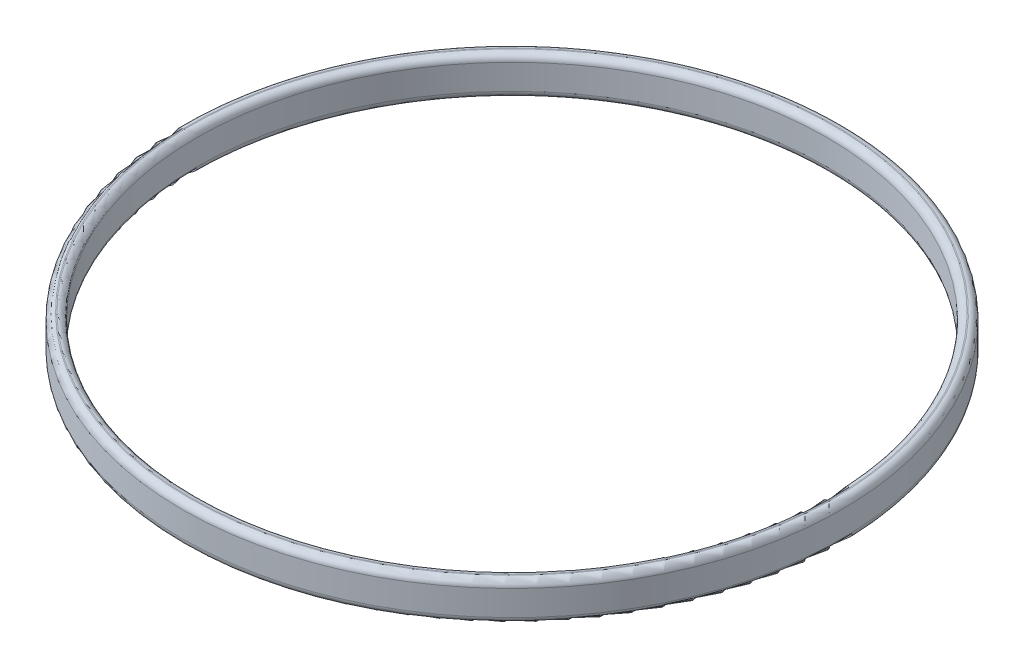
ISO-10303-21;
HEADER;
FILE_DESCRIPTION(('STEP AP214'),'2;1');
FILE_NAME('part.step','',(''),(''),'','','');
FILE_SCHEMA(('AUTOMOTIVE_DESIGN { 1 0 10303 214 1 1 1 1 }'));
ENDSEC;
DATA;
#1=APPLICATION_CONTEXT('core data for automotive mechanical design processes');
#2=APPLICATION_PROTOCOL_DEFINITION('international standard','automotive_design',2000,#1);
#3=PRODUCT_CONTEXT('',#1,'mechanical');
#4=PRODUCT('Part','Part','',(#3));
#5=PRODUCT_RELATED_PRODUCT_CATEGORY('part','',(#4));
#6=PRODUCT_DEFINITION_FORMATION('','',#4);
#7=PRODUCT_DEFINITION_CONTEXT('part definition',#1,'design');
#8=PRODUCT_DEFINITION('design','',#6,#7);
#9=PRODUCT_DEFINITION_SHAPE('','',#8);
#10=(LENGTH_UNIT() NAMED_UNIT(*) SI_UNIT(.MILLI.,.METRE.));
#11=(NAMED_UNIT(*) PLANE_ANGLE_UNIT() SI_UNIT($,.RADIAN.));
#12=(NAMED_UNIT(*) SI_UNIT($,.STERADIAN.) SOLID_ANGLE_UNIT());
#13=UNCERTAINTY_MEASURE_WITH_UNIT(LENGTH_MEASURE(1.E-05),#10,'distance_accuracy_value','');
#14=(GEOMETRIC_REPRESENTATION_CONTEXT(3) GLOBAL_UNCERTAINTY_ASSIGNED_CONTEXT((#13)) GLOBAL_UNIT_ASSIGNED_CONTEXT((#10,
#11,#12)) REPRESENTATION_CONTEXT('',''));
#15=CARTESIAN_POINT('',(0.,0.,0.));
#16=DIRECTION('',(0.,0.,1.));
#17=DIRECTION('',(1.,0.,0.));
#18=AXIS2_PLACEMENT_3D('',#15,#16,#17);
#19=CARTESIAN_POINT('',(0.,1.651,0.));
#20=DIRECTION('',(0.,1.,0.));
#21=DIRECTION('',(0.,0.,1.));
#22=AXIS2_PLACEMENT_3D('',#19,#20,#21);
#23=TOROIDAL_SURFACE('',#22,42.164,0.889000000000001);
#24=CARTESIAN_POINT('',(0.,1.651,0.));
#25=DIRECTION('',(0.,1.,0.));
#26=DIRECTION('',(0.,0.,1.));
#27=AXIS2_PLACEMENT_3D('',#24,#25,#26);
#28=CIRCLE('',#27,41.275);
#29=CARTESIAN_POINT('',(0.,1.651,41.275));
#30=VERTEX_POINT('',#29);
#31=EDGE_CURVE('E60',#30,#30,#28,.T.);
#32=ORIENTED_EDGE('',*,*,#31,.F.);
#33=EDGE_LOOP('',(#32));
#34=FACE_BOUND('',#33,.T.);
#35=CARTESIAN_POINT('',(0.,2.54,0.));
#36=DIRECTION('',(0.,1.,0.));
#37=DIRECTION('',(0.,0.,1.));
#38=AXIS2_PLACEMENT_3D('',#35,#36,#37);
#39=CIRCLE('',#38,42.164);
#40=CARTESIAN_POINT('',(0.,2.54,42.164));
#41=VERTEX_POINT('',#40);
#42=EDGE_CURVE('E10',#41,#41,#39,.T.);
#43=ORIENTED_EDGE('',*,*,#42,.T.);
#44=EDGE_LOOP('',(#43));
#45=FACE_BOUND('',#44,.T.);
#46=ADVANCED_FACE('F32',(#34,#45),#23,.T.);
#47=CARTESIAN_POINT('',(42.164,2.54,0.));
#48=DIRECTION('',(0.,-1.,0.));
#49=DIRECTION('',(0.,0.,-1.));
#50=AXIS2_PLACEMENT_3D('',#47,#48,#49);
#51=PLANE('',#50);
#52=ORIENTED_EDGE('',*,*,#42,.F.);
#53=EDGE_LOOP('',(#52));
#54=FACE_BOUND('',#53,.T.);
#55=CARTESIAN_POINT('',(0.,2.54,0.));
#56=DIRECTION('',(0.,1.,0.));
#57=DIRECTION('',(0.,0.,1.));
#58=AXIS2_PLACEMENT_3D('',#55,#56,#57);
#59=CIRCLE('',#58,42.291);
#60=CARTESIAN_POINT('',(0.,2.54,42.291));
#61=VERTEX_POINT('',#60);
#62=EDGE_CURVE('E38',#61,#61,#59,.T.);
#63=ORIENTED_EDGE('',*,*,#62,.T.);
#64=EDGE_LOOP('',(#63));
#65=FACE_BOUND('',#64,.T.);
#66=ADVANCED_FACE('F67',(#54,#65),#51,.F.);
#67=CARTESIAN_POINT('',(0.,1.651,0.));
#68=DIRECTION('',(0.,1.,0.));
#69=DIRECTION('',(0.,0.,1.));
#70=AXIS2_PLACEMENT_3D('',#67,#68,#69);
#71=TOROIDAL_SURFACE('',#70,42.291,0.889000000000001);
#72=ORIENTED_EDGE('',*,*,#62,.F.);
#73=EDGE_LOOP('',(#72));
#74=FACE_BOUND('',#73,.T.);
#75=CARTESIAN_POINT('',(0.,1.651,0.));
#76=DIRECTION('',(0.,1.,0.));
#77=DIRECTION('',(0.,0.,1.));
#78=AXIS2_PLACEMENT_3D('',#75,#76,#77);
#79=CIRCLE('',#78,43.18);
#80=CARTESIAN_POINT('',(0.,1.651,43.18));
#81=VERTEX_POINT('',#80);
#82=EDGE_CURVE('E42',#81,#81,#79,.T.);
#83=ORIENTED_EDGE('',*,*,#82,.T.);
#84=EDGE_LOOP('',(#83));
#85=FACE_BOUND('',#84,.T.);
#86=ADVANCED_FACE('F71',(#74,#85),#71,.T.);
#87=CARTESIAN_POINT('',(0.,14.7091224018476,0.));
#88=DIRECTION('',(0.,1.,0.));
#89=DIRECTION('',(0.,0.,1.));
#90=AXIS2_PLACEMENT_3D('',#87,#88,#89);
#91=CYLINDRICAL_SURFACE('',#90,43.18);
#92=ORIENTED_EDGE('',*,*,#82,.F.);
#93=EDGE_LOOP('',(#92));
#94=FACE_BOUND('',#93,.T.);
#95=CARTESIAN_POINT('',(0.,-1.651,0.));
#96=DIRECTION('',(0.,1.,0.));
#97=DIRECTION('',(0.,0.,1.));
#98=AXIS2_PLACEMENT_3D('',#95,#96,#97);
#99=CIRCLE('',#98,43.18);
#100=CARTESIAN_POINT('',(0.,-1.651,43.18));
#101=VERTEX_POINT('',#100);
#102=EDGE_CURVE('E46',#101,#101,#99,.T.);
#103=ORIENTED_EDGE('',*,*,#102,.T.);
#104=EDGE_LOOP('',(#103));
#105=FACE_BOUND('',#104,.T.);
#106=ADVANCED_FACE('F76',(#94,#105),#91,.T.);
#107=CARTESIAN_POINT('',(0.,-1.651,0.));
#108=DIRECTION('',(0.,1.,0.));
#109=DIRECTION('',(0.,0.,1.));
#110=AXIS2_PLACEMENT_3D('',#107,#108,#109);
#111=TOROIDAL_SURFACE('',#110,42.291,0.889000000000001);
#112=ORIENTED_EDGE('',*,*,#102,.F.);
#113=EDGE_LOOP('',(#112));
#114=FACE_BOUND('',#113,.T.);
#115=CARTESIAN_POINT('',(0.,-2.54,0.));
#116=DIRECTION('',(0.,1.,0.));
#117=DIRECTION('',(0.,0.,1.));
#118=AXIS2_PLACEMENT_3D('',#115,#116,#117);
#119=CIRCLE('',#118,42.291);
#120=CARTESIAN_POINT('',(0.,-2.54,42.291));
#121=VERTEX_POINT('',#120);
#122=EDGE_CURVE('E51',#121,#121,#119,.T.);
#123=ORIENTED_EDGE('',*,*,#122,.T.);
#124=EDGE_LOOP('',(#123));
#125=FACE_BOUND('',#124,.T.);
#126=ADVANCED_FACE('F82',(#114,#125),#111,.T.);
#127=CARTESIAN_POINT('',(42.164,-2.54,0.));
#128=DIRECTION('',(0.,1.,0.));
#129=DIRECTION('',(0.,0.,1.));
#130=AXIS2_PLACEMENT_3D('',#127,#128,#129);
#131=PLANE('',#130);
#132=ORIENTED_EDGE('',*,*,#122,.F.);
#133=EDGE_LOOP('',(#132));
#134=FACE_BOUND('',#133,.T.);
#135=CARTESIAN_POINT('',(0.,-2.54,0.));
#136=DIRECTION('',(0.,1.,0.));
#137=DIRECTION('',(0.,0.,1.));
#138=AXIS2_PLACEMENT_3D('',#135,#136,#137);
#139=CIRCLE('',#138,42.164);
#140=CARTESIAN_POINT('',(0.,-2.54,42.164));
#141=VERTEX_POINT('',#140);
#142=EDGE_CURVE('E54',#141,#141,#139,.T.);
#143=ORIENTED_EDGE('',*,*,#142,.T.);
#144=EDGE_LOOP('',(#143));
#145=FACE_BOUND('',#144,.T.);
#146=ADVANCED_FACE('F86',(#134,#145),#131,.F.);
#147=CARTESIAN_POINT('',(0.,-1.651,0.));
#148=DIRECTION('',(0.,1.,0.));
#149=DIRECTION('',(0.,0.,1.));
#150=AXIS2_PLACEMENT_3D('',#147,#148,#149);
#151=TOROIDAL_SURFACE('',#150,42.164,0.889000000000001);
#152=ORIENTED_EDGE('',*,*,#142,.F.);
#153=EDGE_LOOP('',(#152));
#154=FACE_BOUND('',#153,.T.);
#155=CARTESIAN_POINT('',(0.,-1.651,0.));
#156=DIRECTION('',(0.,1.,0.));
#157=DIRECTION('',(0.,0.,1.));
#158=AXIS2_PLACEMENT_3D('',#155,#156,#157);
#159=CIRCLE('',#158,41.275);
#160=CARTESIAN_POINT('',(0.,-1.651,41.275));
#161=VERTEX_POINT('',#160);
#162=EDGE_CURVE('E57',#161,#161,#159,.T.);
#163=ORIENTED_EDGE('',*,*,#162,.T.);
#164=EDGE_LOOP('',(#163));
#165=FACE_BOUND('',#164,.T.);
#166=ADVANCED_FACE('F90',(#154,#165),#151,.T.);
#167=CARTESIAN_POINT('',(0.,14.7091224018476,0.));
#168=DIRECTION('',(0.,1.,0.));
#169=DIRECTION('',(0.,0.,1.));
#170=AXIS2_PLACEMENT_3D('',#167,#168,#169);
#171=CYLINDRICAL_SURFACE('',#170,41.275);
#172=ORIENTED_EDGE('',*,*,#162,.F.);
#173=EDGE_LOOP('',(#172));
#174=FACE_BOUND('',#173,.T.);
#175=ORIENTED_EDGE('',*,*,#31,.T.);
#176=EDGE_LOOP('',(#175));
#177=FACE_BOUND('',#176,.T.);
#178=ADVANCED_FACE('F64',(#174,#177),#171,.F.);
#179=CLOSED_SHELL('',(#46,#66,#86,#106,#126,#146,#166,#178));
#180=MANIFOLD_SOLID_BREP('B2',#179);
#181=ADVANCED_BREP_SHAPE_REPRESENTATION('',(#18,#180),#14);
#182=SHAPE_DEFINITION_REPRESENTATION(#9,#181);
ENDSEC;
END-ISO-10303-21;
